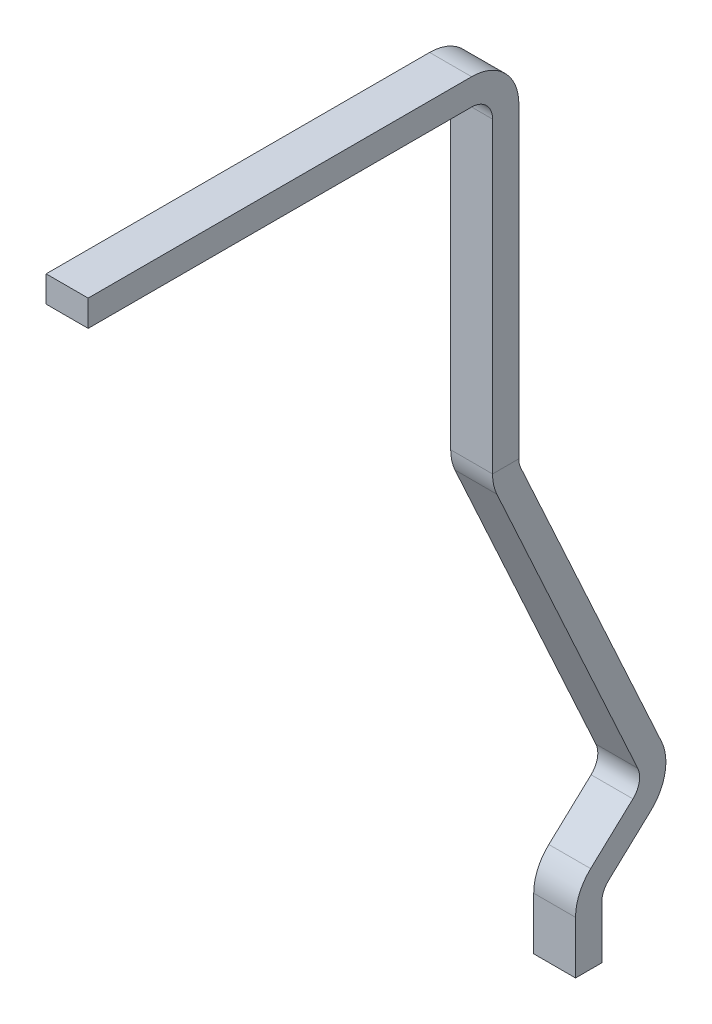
ISO-10303-21;
HEADER;
FILE_DESCRIPTION(('STEP AP214'),'2;1');
FILE_NAME('part.step','',(''),(''),'','','');
FILE_SCHEMA(('AUTOMOTIVE_DESIGN { 1 0 10303 214 1 1 1 1 }'));
ENDSEC;
DATA;
#1=APPLICATION_CONTEXT('core data for automotive mechanical design processes');
#2=APPLICATION_PROTOCOL_DEFINITION('international standard','automotive_design',2000,#1);
#3=PRODUCT_CONTEXT('',#1,'mechanical');
#4=PRODUCT('Part','Part','',(#3));
#5=PRODUCT_RELATED_PRODUCT_CATEGORY('part','',(#4));
#6=PRODUCT_DEFINITION_FORMATION('','',#4);
#7=PRODUCT_DEFINITION_CONTEXT('part definition',#1,'design');
#8=PRODUCT_DEFINITION('design','',#6,#7);
#9=PRODUCT_DEFINITION_SHAPE('','',#8);
#10=(LENGTH_UNIT() NAMED_UNIT(*) SI_UNIT(.MILLI.,.METRE.));
#11=(NAMED_UNIT(*) PLANE_ANGLE_UNIT() SI_UNIT($,.RADIAN.));
#12=(NAMED_UNIT(*) SI_UNIT($,.STERADIAN.) SOLID_ANGLE_UNIT());
#13=UNCERTAINTY_MEASURE_WITH_UNIT(LENGTH_MEASURE(1.E-05),#10,'distance_accuracy_value','');
#14=(GEOMETRIC_REPRESENTATION_CONTEXT(3) GLOBAL_UNCERTAINTY_ASSIGNED_CONTEXT((#13)) GLOBAL_UNIT_ASSIGNED_CONTEXT((#10,
#11,#12)) REPRESENTATION_CONTEXT('',''));
#15=CARTESIAN_POINT('',(0.,0.,0.));
#16=DIRECTION('',(0.,0.,1.));
#17=DIRECTION('',(1.,0.,0.));
#18=AXIS2_PLACEMENT_3D('',#15,#16,#17);
#19=CARTESIAN_POINT('',(0.20000000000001,-1.4625,-0.125));
#20=DIRECTION('',(0.,0.,-1.));
#21=DIRECTION('',(-1.,0.,0.));
#22=AXIS2_PLACEMENT_3D('',#19,#20,#21);
#23=PLANE('',#22);
#24=DIRECTION('',(-1.,0.,0.));
#25=VECTOR('',#24,1.);
#26=CARTESIAN_POINT('',(0.,-1.4625,-0.125));
#27=LINE('',#26,#25);
#28=CARTESIAN_POINT('',(0.199333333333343,-1.4625,-0.125));
#29=VERTEX_POINT('',#28);
#30=CARTESIAN_POINT('',(-0.19933333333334,-1.4625,-0.125));
#31=VERTEX_POINT('',#30);
#32=EDGE_CURVE('E232',#29,#31,#27,.T.);
#33=ORIENTED_EDGE('',*,*,#32,.T.);
#34=DIRECTION('',(0.,-1.,0.));
#35=VECTOR('',#34,1.);
#36=CARTESIAN_POINT('',(-0.2,0.225,-0.125));
#37=LINE('',#36,#35);
#38=CARTESIAN_POINT('',(-0.2,1.4625,-0.125));
#39=VERTEX_POINT('',#38);
#40=EDGE_CURVE('E236',#39,#31,#37,.T.);
#41=ORIENTED_EDGE('',*,*,#40,.F.);
#42=DIRECTION('',(-1.,0.,0.));
#43=VECTOR('',#42,1.);
#44=CARTESIAN_POINT('',(0.,1.4625,-0.125));
#45=LINE('',#44,#43);
#46=CARTESIAN_POINT('',(0.200000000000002,1.46250000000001,-0.125));
#47=VERTEX_POINT('',#46);
#48=EDGE_CURVE('E211',#47,#39,#45,.T.);
#49=ORIENTED_EDGE('',*,*,#48,.F.);
#50=DIRECTION('',(0.,1.,0.));
#51=VECTOR('',#50,1.);
#52=CARTESIAN_POINT('',(0.200000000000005,0.225,-0.125));
#53=LINE('',#52,#51);
#54=EDGE_CURVE('E205',#29,#47,#53,.T.);
#55=ORIENTED_EDGE('',*,*,#54,.F.);
#56=EDGE_LOOP('',(#33,#41,#49,#55));
#57=FACE_BOUND('',#56,.T.);
#58=ADVANCED_FACE('F16',(#57),#23,.T.);
#59=CARTESIAN_POINT('',(-0.2,1.6625,0.325));
#60=DIRECTION('',(0.,-1.,0.));
#61=DIRECTION('',(1.,0.,0.));
#62=AXIS2_PLACEMENT_3D('',#59,#60,#61);
#63=PLANE('',#62);
#64=DIRECTION('',(0.,0.,1.));
#65=VECTOR('',#64,1.);
#66=CARTESIAN_POINT('',(-0.2,1.66250000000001,1.925));
#67=LINE('',#66,#65);
#68=CARTESIAN_POINT('',(-0.2,1.66250000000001,0.325));
#69=VERTEX_POINT('',#68);
#70=CARTESIAN_POINT('',(-0.2,1.66250000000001,3.975));
#71=VERTEX_POINT('',#70);
#72=EDGE_CURVE('E163',#69,#71,#67,.T.);
#73=ORIENTED_EDGE('',*,*,#72,.F.);
#74=DIRECTION('',(-1.,0.,0.));
#75=VECTOR('',#74,1.);
#76=CARTESIAN_POINT('',(0.,1.66250000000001,0.325));
#77=LINE('',#76,#75);
#78=CARTESIAN_POINT('',(0.200000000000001,1.66250000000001,0.325000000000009));
#79=VERTEX_POINT('',#78);
#80=EDGE_CURVE('E159',#79,#69,#77,.T.);
#81=ORIENTED_EDGE('',*,*,#80,.F.);
#82=DIRECTION('',(0.,0.,-1.));
#83=VECTOR('',#82,1.);
#84=CARTESIAN_POINT('',(0.200000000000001,1.66250000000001,1.925));
#85=LINE('',#84,#83);
#86=CARTESIAN_POINT('',(0.200000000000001,1.66250000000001,3.975));
#87=VERTEX_POINT('',#86);
#88=EDGE_CURVE('E193',#87,#79,#85,.T.);
#89=ORIENTED_EDGE('',*,*,#88,.F.);
#90=DIRECTION('',(1.,0.,0.));
#91=VECTOR('',#90,1.);
#92=CARTESIAN_POINT('',(0.,1.6625,3.975));
#93=LINE('',#92,#91);
#94=EDGE_CURVE('E222',#71,#87,#93,.T.);
#95=ORIENTED_EDGE('',*,*,#94,.F.);
#96=EDGE_LOOP('',(#73,#81,#89,#95));
#97=FACE_BOUND('',#96,.T.);
#98=ADVANCED_FACE('F488',(#97),#63,.T.);
#99=CARTESIAN_POINT('',(-0.2,1.9125,3.975));
#100=DIRECTION('',(0.,0.,1.));
#101=DIRECTION('',(0.,-1.,0.));
#102=AXIS2_PLACEMENT_3D('',#99,#100,#101);
#103=PLANE('',#102);
#104=DIRECTION('',(0.,1.,0.));
#105=VECTOR('',#104,1.);
#106=CARTESIAN_POINT('',(-0.2,0.225,3.975));
#107=LINE('',#106,#105);
#108=CARTESIAN_POINT('',(-0.2,1.9125,3.975));
#109=VERTEX_POINT('',#108);
#110=EDGE_CURVE('E225',#71,#109,#107,.T.);
#111=ORIENTED_EDGE('',*,*,#110,.F.);
#112=ORIENTED_EDGE('',*,*,#94,.T.);
#113=DIRECTION('',(0.,-1.,0.));
#114=VECTOR('',#113,1.);
#115=CARTESIAN_POINT('',(0.200000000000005,0.225,3.975));
#116=LINE('',#115,#114);
#117=CARTESIAN_POINT('',(0.2,1.9125,3.975));
#118=VERTEX_POINT('',#117);
#119=EDGE_CURVE('E196',#118,#87,#116,.T.);
#120=ORIENTED_EDGE('',*,*,#119,.F.);
#121=DIRECTION('',(1.,0.,0.));
#122=VECTOR('',#121,1.);
#123=CARTESIAN_POINT('',(0.,1.9125,3.975));
#124=LINE('',#123,#122);
#125=EDGE_CURVE('E218',#109,#118,#124,.T.);
#126=ORIENTED_EDGE('',*,*,#125,.F.);
#127=EDGE_LOOP('',(#111,#112,#120,#126));
#128=FACE_BOUND('',#127,.T.);
#129=ADVANCED_FACE('F486',(#128),#103,.T.);
#130=CARTESIAN_POINT('',(0.2,1.9125,0.325));
#131=DIRECTION('',(0.,1.,0.));
#132=DIRECTION('',(-1.,0.,0.));
#133=AXIS2_PLACEMENT_3D('',#130,#131,#132);
#134=PLANE('',#133);
#135=DIRECTION('',(0.,0.,1.));
#136=VECTOR('',#135,1.);
#137=CARTESIAN_POINT('',(0.2,1.9125,1.925));
#138=LINE('',#137,#136);
#139=CARTESIAN_POINT('',(0.200000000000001,1.9125,0.325000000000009));
#140=VERTEX_POINT('',#139);
#141=EDGE_CURVE('E199',#140,#118,#138,.T.);
#142=ORIENTED_EDGE('',*,*,#141,.F.);
#143=DIRECTION('',(1.,0.,0.));
#144=VECTOR('',#143,1.);
#145=CARTESIAN_POINT('',(0.,1.9125,0.325));
#146=LINE('',#145,#144);
#147=CARTESIAN_POINT('',(-0.2,1.9125,0.325));
#148=VERTEX_POINT('',#147);
#149=EDGE_CURVE('E214',#148,#140,#146,.T.);
#150=ORIENTED_EDGE('',*,*,#149,.F.);
#151=DIRECTION('',(0.,0.,-1.));
#152=VECTOR('',#151,1.);
#153=CARTESIAN_POINT('',(-0.2,1.9125,1.925));
#154=LINE('',#153,#152);
#155=EDGE_CURVE('E228',#109,#148,#154,.T.);
#156=ORIENTED_EDGE('',*,*,#155,.F.);
#157=ORIENTED_EDGE('',*,*,#125,.T.);
#158=EDGE_LOOP('',(#142,#150,#156,#157));
#159=FACE_BOUND('',#158,.T.);
#160=ADVANCED_FACE('F266',(#159),#134,.T.);
#161=CARTESIAN_POINT('',(0.24,1.4625,0.325));
#162=DIRECTION('',(-1.,0.,0.));
#163=DIRECTION('',(0.,0.,1.));
#164=AXIS2_PLACEMENT_3D('',#161,#162,#163);
#165=CYLINDRICAL_SURFACE('',#164,0.45);
#166=CARTESIAN_POINT('',(0.200000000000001,1.46250000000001,-0.125));
#167=CARTESIAN_POINT('',(0.200000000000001,1.50787190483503,-0.124593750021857));
#168=CARTESIAN_POINT('',(0.200000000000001,1.55029064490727,-0.116353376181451));
#169=CARTESIAN_POINT('',(0.200000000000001,1.59182042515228,-0.108285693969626));
#170=CARTESIAN_POINT('',(0.200000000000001,1.6347075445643,-0.090745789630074));
#171=CARTESIAN_POINT('',(0.200000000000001,1.71569158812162,-0.0576250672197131));
#172=CARTESIAN_POINT('',(0.2,1.78069805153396,0.00680194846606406));
#173=CARTESIAN_POINT('',(0.2,1.84284280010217,0.0683927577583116));
#174=CARTESIAN_POINT('',(0.2,1.87824578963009,0.152792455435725));
#175=CARTESIAN_POINT('',(0.2,1.91167158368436,0.232478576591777));
#176=CARTESIAN_POINT('',(0.2,1.9125,0.325000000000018));
#177=B_SPLINE_CURVE_WITH_KNOTS('',2,(#166,#167,#168,#169,#170,#171,#172,#173,#174,#175,#176),
.UNSPECIFIED.,.F.,.F.,(3,2,2,2,2,3),(0.,0.125,0.25,0.5,0.75,1.),.UNSPECIFIED.);
#178=EDGE_CURVE('E202',#47,#140,#177,.T.);
#179=ORIENTED_EDGE('',*,*,#178,.F.);
#180=ORIENTED_EDGE('',*,*,#48,.T.);
#181=CARTESIAN_POINT('',(-0.2,1.4625,0.325));
#182=DIRECTION('',(-1.,0.,0.));
#183=DIRECTION('',(0.,0.,1.));
#184=AXIS2_PLACEMENT_3D('',#181,#182,#183);
#185=CIRCLE('',#184,0.45);
#186=EDGE_CURVE('E181',#148,#39,#185,.T.);
#187=ORIENTED_EDGE('',*,*,#186,.F.);
#188=ORIENTED_EDGE('',*,*,#149,.T.);
#189=EDGE_LOOP('',(#179,#180,#187,#188));
#190=FACE_BOUND('',#189,.T.);
#191=ADVANCED_FACE('F255',(#190),#165,.T.);
#192=CARTESIAN_POINT('',(0.20000000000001,-1.4625,-0.125));
#193=DIRECTION('',(1.,0.,0.));
#194=DIRECTION('',(0.,1.,0.));
#195=AXIS2_PLACEMENT_3D('',#192,#193,#194);
#196=PLANE('',#195);
#197=ORIENTED_EDGE('',*,*,#88,.T.);
#198=CARTESIAN_POINT('',(0.200000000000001,1.4625,0.325));
#199=DIRECTION('',(1.,0.,0.));
#200=DIRECTION('',(0.,0.,-1.));
#201=AXIS2_PLACEMENT_3D('',#198,#199,#200);
#202=CIRCLE('',#201,0.200000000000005);
#203=CARTESIAN_POINT('',(0.200000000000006,1.4625,0.125000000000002));
#204=VERTEX_POINT('',#203);
#205=EDGE_CURVE('E195',#204,#79,#202,.T.);
#206=ORIENTED_EDGE('',*,*,#205,.F.);
#207=DIRECTION('',(0.,1.,0.));
#208=VECTOR('',#207,1.);
#209=CARTESIAN_POINT('',(0.20000000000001,0.,0.125));
#210=LINE('',#209,#208);
#211=CARTESIAN_POINT('',(0.199333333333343,-1.4625,0.125000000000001));
#212=VERTEX_POINT('',#211);
#213=EDGE_CURVE('E179',#212,#204,#210,.T.);
#214=ORIENTED_EDGE('',*,*,#213,.F.);
#215=CARTESIAN_POINT('',(0.20000000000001,-1.4625,0.125000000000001));
#216=DIRECTION('',(0.,0.,-1.));
#217=VECTOR('',#216,1.);
#218=LINE('',#215,#217);
#219=EDGE_CURVE('E208',#212,#29,#218,.T.);
#220=ORIENTED_EDGE('',*,*,#219,.T.);
#221=ORIENTED_EDGE('',*,*,#54,.T.);
#222=ORIENTED_EDGE('',*,*,#178,.T.);
#223=ORIENTED_EDGE('',*,*,#141,.T.);
#224=ORIENTED_EDGE('',*,*,#119,.T.);
#225=EDGE_LOOP('',(#197,#206,#214,#220,#221,#222,#223,#224));
#226=FACE_BOUND('',#225,.T.);
#227=ADVANCED_FACE('F265',(#226),#196,.T.);
#228=CARTESIAN_POINT('',(0.24,1.4625,0.325));
#229=DIRECTION('',(-1.,0.,0.));
#230=DIRECTION('',(0.,0.,1.));
#231=AXIS2_PLACEMENT_3D('',#228,#229,#230);
#232=CYLINDRICAL_SURFACE('',#231,0.200000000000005);
#233=CARTESIAN_POINT('',(-0.2,1.4625,0.325));
#234=DIRECTION('',(-1.,0.,0.));
#235=DIRECTION('',(0.,0.,1.));
#236=AXIS2_PLACEMENT_3D('',#233,#234,#235);
#237=CIRCLE('',#236,0.200000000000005);
#238=CARTESIAN_POINT('',(-0.200000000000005,1.4625,0.125));
#239=VERTEX_POINT('',#238);
#240=EDGE_CURVE('E20',#239,#69,#237,.F.);
#241=ORIENTED_EDGE('',*,*,#240,.F.);
#242=DIRECTION('',(-1.,0.,0.));
#243=VECTOR('',#242,1.);
#244=CARTESIAN_POINT('',(0.,1.4625,0.125));
#245=LINE('',#244,#243);
#246=EDGE_CURVE('E156',#204,#239,#245,.T.);
#247=ORIENTED_EDGE('',*,*,#246,.F.);
#248=ORIENTED_EDGE('',*,*,#205,.T.);
#249=ORIENTED_EDGE('',*,*,#80,.T.);
#250=EDGE_LOOP('',(#241,#247,#248,#249));
#251=FACE_BOUND('',#250,.T.);
#252=ADVANCED_FACE('F153',(#251),#232,.F.);
#253=CARTESIAN_POINT('',(-0.2,1.9125,-0.125));
#254=DIRECTION('',(-1.,0.,0.));
#255=DIRECTION('',(0.,-1.,0.));
#256=AXIS2_PLACEMENT_3D('',#253,#254,#255);
#257=PLANE('',#256);
#258=ORIENTED_EDGE('',*,*,#155,.T.);
#259=ORIENTED_EDGE('',*,*,#186,.T.);
#260=ORIENTED_EDGE('',*,*,#40,.T.);
#261=CARTESIAN_POINT('',(-0.2,-1.4625,-0.124999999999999));
#262=DIRECTION('',(0.,0.,1.));
#263=VECTOR('',#262,1.);
#264=LINE('',#261,#263);
#265=CARTESIAN_POINT('',(-0.19933333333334,-1.4625,0.125000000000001));
#266=VERTEX_POINT('',#265);
#267=EDGE_CURVE('E164',#31,#266,#264,.T.);
#268=ORIENTED_EDGE('',*,*,#267,.T.);
#269=DIRECTION('',(0.,-1.,0.));
#270=VECTOR('',#269,1.);
#271=CARTESIAN_POINT('',(-0.20000000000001,0.,0.125));
#272=LINE('',#271,#270);
#273=EDGE_CURVE('E167',#239,#266,#272,.T.);
#274=ORIENTED_EDGE('',*,*,#273,.F.);
#275=ORIENTED_EDGE('',*,*,#240,.T.);
#276=ORIENTED_EDGE('',*,*,#72,.T.);
#277=ORIENTED_EDGE('',*,*,#110,.T.);
#278=EDGE_LOOP('',(#258,#259,#260,#268,#274,#275,#276,#277));
#279=FACE_BOUND('',#278,.T.);
#280=ADVANCED_FACE('F169',(#279),#257,.T.);
#281=CARTESIAN_POINT('',(-0.20000000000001,-1.4625,0.125));
#282=DIRECTION('',(0.,0.,1.));
#283=DIRECTION('',(1.,0.,0.));
#284=AXIS2_PLACEMENT_3D('',#281,#282,#283);
#285=PLANE('',#284);
#286=DIRECTION('',(-1.,0.,0.));
#287=VECTOR('',#286,1.);
#288=CARTESIAN_POINT('',(0.,-1.4625,0.125));
#289=LINE('',#288,#287);
#290=EDGE_CURVE('E442',#212,#266,#289,.T.);
#291=ORIENTED_EDGE('',*,*,#290,.F.);
#292=ORIENTED_EDGE('',*,*,#213,.T.);
#293=ORIENTED_EDGE('',*,*,#246,.T.);
#294=ORIENTED_EDGE('',*,*,#273,.T.);
#295=EDGE_LOOP('',(#291,#292,#293,#294));
#296=FACE_BOUND('',#295,.T.);
#297=ADVANCED_FACE('F177',(#296),#285,.T.);
#298=CARTESIAN_POINT('',(-0.19900000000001,-1.4625,-1.5349));
#299=DIRECTION('',(-1.,0.,0.));
#300=DIRECTION('',(0.,-1.,0.));
#301=AXIS2_PLACEMENT_3D('',#298,#299,#300);
#302=PLANE('',#301);
#303=CARTESIAN_POINT('',(-0.199000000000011,-1.4625,-0.325000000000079));
#304=DIRECTION('',(1.,0.,0.));
#305=DIRECTION('',(0.,0.,-1.));
#306=AXIS2_PLACEMENT_3D('',#303,#304,#305);
#307=CIRCLE('',#306,0.450000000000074);
#308=CARTESIAN_POINT('',(-0.199000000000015,-1.64980458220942,0.0841662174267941));
#309=VERTEX_POINT('',#308);
#310=EDGE_CURVE('E444',#266,#309,#307,.T.);
#311=ORIENTED_EDGE('',*,*,#310,.F.);
#312=ORIENTED_EDGE('',*,*,#267,.F.);
#313=CARTESIAN_POINT('',(-0.19900000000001,-1.4625,-0.32499999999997));
#314=DIRECTION('',(1.,0.,0.));
#315=DIRECTION('',(0.,0.,-1.));
#316=AXIS2_PLACEMENT_3D('',#313,#314,#315);
#317=CIRCLE('',#316,0.199999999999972);
#318=CARTESIAN_POINT('',(-0.199000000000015,-1.54574648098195,-0.143148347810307));
#319=VERTEX_POINT('',#318);
#320=EDGE_CURVE('E454',#319,#31,#317,.F.);
#321=ORIENTED_EDGE('',*,*,#320,.F.);
#322=DIRECTION('',(0.,0.909258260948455,0.416232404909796));
#323=VECTOR('',#322,1.);
#324=CARTESIAN_POINT('',(-0.19900000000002,-3.01047094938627,-0.81365728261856));
#325=LINE('',#324,#323);
#326=CARTESIAN_POINT('',(-0.199000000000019,-4.47519541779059,-1.48416621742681));
#327=VERTEX_POINT('',#326);
#328=EDGE_CURVE('E447',#327,#319,#325,.T.);
#329=ORIENTED_EDGE('',*,*,#328,.F.);
#330=CARTESIAN_POINT('',(-0.199000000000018,-4.66250000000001,-1.07499999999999));
#331=DIRECTION('',(-1.,0.,0.));
#332=DIRECTION('',(0.,0.,1.));
#333=AXIS2_PLACEMENT_3D('',#330,#331,#332);
#334=CIRCLE('',#333,0.450000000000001);
#335=CARTESIAN_POINT('',(-0.199000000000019,-4.99220548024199,-1.38125854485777));
#336=VERTEX_POINT('',#335);
#337=EDGE_CURVE('E451',#336,#327,#334,.F.);
#338=ORIENTED_EDGE('',*,*,#337,.F.);
#339=DIRECTION('',(0.,0.680574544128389,-0.73267884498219));
#340=VECTOR('',#339,1.);
#341=CARTESIAN_POINT('',(-0.19900000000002,-5.17908485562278,-1.18007181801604));
#342=LINE('',#341,#340);
#343=CARTESIAN_POINT('',(-0.199000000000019,-5.36596423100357,-0.978885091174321));
#344=VERTEX_POINT('',#343);
#345=EDGE_CURVE('E460',#344,#336,#342,.T.);
#346=ORIENTED_EDGE('',*,*,#345,.F.);
#347=CARTESIAN_POINT('',(-0.199000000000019,-5.5125,-1.115));
#348=DIRECTION('',(1.,0.,0.));
#349=DIRECTION('',(0.,0.,-1.));
#350=AXIS2_PLACEMENT_3D('',#347,#348,#349);
#351=CIRCLE('',#350,0.199999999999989);
#352=CARTESIAN_POINT('',(-0.199000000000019,-5.5125,-0.915000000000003));
#353=VERTEX_POINT('',#352);
#354=EDGE_CURVE('E428',#353,#344,#351,.F.);
#355=ORIENTED_EDGE('',*,*,#354,.F.);
#356=DIRECTION('',(0.,-1.,0.));
#357=VECTOR('',#356,1.);
#358=CARTESIAN_POINT('',(-0.199000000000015,-3.7375,-0.915000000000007));
#359=LINE('',#358,#357);
#360=CARTESIAN_POINT('',(-0.19900000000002,-6.0125,-0.915000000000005));
#361=VERTEX_POINT('',#360);
#362=EDGE_CURVE('E175',#353,#361,#359,.T.);
#363=ORIENTED_EDGE('',*,*,#362,.T.);
#364=DIRECTION('',(0.,0.,1.));
#365=VECTOR('',#364,1.);
#366=CARTESIAN_POINT('',(-0.19900000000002,-6.0125,-0.7));
#367=LINE('',#366,#365);
#368=CARTESIAN_POINT('',(-0.19900000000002,-6.0125,-0.665000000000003));
#369=VERTEX_POINT('',#368);
#370=EDGE_CURVE('E408',#361,#369,#367,.T.);
#371=ORIENTED_EDGE('',*,*,#370,.T.);
#372=DIRECTION('',(0.,1.,0.));
#373=VECTOR('',#372,1.);
#374=CARTESIAN_POINT('',(-0.199000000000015,-3.7375,-0.665000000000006));
#375=LINE('',#374,#373);
#376=CARTESIAN_POINT('',(-0.199000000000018,-5.5125,-0.665000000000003));
#377=VERTEX_POINT('',#376);
#378=EDGE_CURVE('E452',#369,#377,#375,.T.);
#379=ORIENTED_EDGE('',*,*,#378,.T.);
#380=CARTESIAN_POINT('',(-0.199000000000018,-5.5125,-1.11499999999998));
#381=DIRECTION('',(1.,0.,0.));
#382=DIRECTION('',(0.,0.,-1.));
#383=AXIS2_PLACEMENT_3D('',#380,#381,#382);
#384=CIRCLE('',#383,0.449999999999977);
#385=CARTESIAN_POINT('',(-0.199000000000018,-5.18279451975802,-0.808741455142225));
#386=VERTEX_POINT('',#385);
#387=EDGE_CURVE('E429',#386,#377,#384,.T.);
#388=ORIENTED_EDGE('',*,*,#387,.F.);
#389=DIRECTION('',(0.,-0.680574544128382,0.732678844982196));
#390=VECTOR('',#389,1.);
#391=CARTESIAN_POINT('',(-0.19900000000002,-4.99591514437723,-1.00992818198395));
#392=LINE('',#391,#390);
#393=CARTESIAN_POINT('',(-0.199000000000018,-4.80903576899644,-1.21111490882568));
#394=VERTEX_POINT('',#393);
#395=EDGE_CURVE('E433',#394,#386,#392,.T.);
#396=ORIENTED_EDGE('',*,*,#395,.F.);
#397=CARTESIAN_POINT('',(-0.199000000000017,-4.6625,-1.07499999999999));
#398=DIRECTION('',(-1.,0.,0.));
#399=DIRECTION('',(0.,0.,1.));
#400=AXIS2_PLACEMENT_3D('',#397,#398,#399);
#401=CIRCLE('',#400,0.200000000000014);
#402=CARTESIAN_POINT('',(-0.199000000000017,-4.57925351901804,-1.25685165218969));
#403=VERTEX_POINT('',#402);
#404=EDGE_CURVE('E437',#403,#394,#401,.T.);
#405=ORIENTED_EDGE('',*,*,#404,.F.);
#406=DIRECTION('',(0.,-0.909258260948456,-0.416232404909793));
#407=VECTOR('',#406,1.);
#408=CARTESIAN_POINT('',(-0.19900000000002,-3.11452905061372,-0.586342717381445));
#409=LINE('',#408,#407);
#410=EDGE_CURVE('E441',#309,#403,#409,.T.);
#411=ORIENTED_EDGE('',*,*,#410,.F.);
#412=EDGE_LOOP('',(#311,#312,#321,#329,#338,#346,#355,#363,#371,#379,#388,#396,#405,#411));
#413=FACE_BOUND('',#412,.T.);
#414=ADVANCED_FACE('F321',(#413),#302,.T.);
#415=CARTESIAN_POINT('',(-0.23880000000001,-1.4625,-0.32499999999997));
#416=DIRECTION('',(1.,0.,0.));
#417=DIRECTION('',(0.,0.,-1.));
#418=AXIS2_PLACEMENT_3D('',#415,#416,#417);
#419=CYLINDRICAL_SURFACE('',#418,0.199999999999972);
#420=CARTESIAN_POINT('',(0.19900000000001,-1.4625,-0.32499999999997));
#421=DIRECTION('',(1.,0.,0.));
#422=DIRECTION('',(0.,0.,-1.));
#423=AXIS2_PLACEMENT_3D('',#420,#421,#422);
#424=CIRCLE('',#423,0.199999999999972);
#425=CARTESIAN_POINT('',(0.19900000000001,-1.54574648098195,-0.143148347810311));
#426=VERTEX_POINT('',#425);
#427=EDGE_CURVE('E619',#426,#29,#424,.F.);
#428=ORIENTED_EDGE('',*,*,#427,.F.);
#429=DIRECTION('',(1.,0.,0.));
#430=VECTOR('',#429,1.);
#431=CARTESIAN_POINT('',(0.,-1.54574648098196,-0.14314834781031));
#432=LINE('',#431,#430);
#433=EDGE_CURVE('E450',#319,#426,#432,.T.);
#434=ORIENTED_EDGE('',*,*,#433,.F.);
#435=ORIENTED_EDGE('',*,*,#320,.T.);
#436=ORIENTED_EDGE('',*,*,#32,.F.);
#437=EDGE_LOOP('',(#428,#434,#435,#436));
#438=FACE_BOUND('',#437,.T.);
#439=ADVANCED_FACE('F325',(#438),#419,.F.);
#440=CARTESIAN_POINT('',(-0.238800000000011,-1.4625,-0.325000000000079));
#441=DIRECTION('',(1.,0.,0.));
#442=DIRECTION('',(0.,0.,-1.));
#443=AXIS2_PLACEMENT_3D('',#440,#441,#442);
#444=CYLINDRICAL_SURFACE('',#443,0.450000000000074);
#445=CARTESIAN_POINT('',(0.19900000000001,-1.4625,-0.32500000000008));
#446=DIRECTION('',(1.,0.,0.));
#447=DIRECTION('',(0.,0.,-1.));
#448=AXIS2_PLACEMENT_3D('',#445,#446,#447);
#449=CIRCLE('',#448,0.450000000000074);
#450=CARTESIAN_POINT('',(0.199000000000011,-1.64980458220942,0.0841662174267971));
#451=VERTEX_POINT('',#450);
#452=EDGE_CURVE('E615',#212,#451,#449,.T.);
#453=ORIENTED_EDGE('',*,*,#452,.F.);
#454=ORIENTED_EDGE('',*,*,#290,.T.);
#455=ORIENTED_EDGE('',*,*,#310,.T.);
#456=DIRECTION('',(-1.,0.,0.));
#457=VECTOR('',#456,1.);
#458=CARTESIAN_POINT('',(0.,-1.64980458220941,0.0841662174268));
#459=LINE('',#458,#457);
#460=EDGE_CURVE('E438',#451,#309,#459,.T.);
#461=ORIENTED_EDGE('',*,*,#460,.F.);
#462=EDGE_LOOP('',(#453,#454,#455,#461));
#463=FACE_BOUND('',#462,.T.);
#464=ADVANCED_FACE('F391',(#463),#444,.T.);
#465=CARTESIAN_POINT('',(-0.19900000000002,-1.64980458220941,0.0841662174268));
#466=DIRECTION('',(0.,-0.416232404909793,0.909258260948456));
#467=DIRECTION('',(0.,-0.909258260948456,-0.416232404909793));
#468=AXIS2_PLACEMENT_3D('',#465,#466,#467);
#469=PLANE('',#468);
#470=DIRECTION('',(0.,-0.909258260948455,-0.416232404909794));
#471=VECTOR('',#470,1.);
#472=CARTESIAN_POINT('',(0.19900000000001,-1.64980458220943,0.0841662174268));
#473=LINE('',#472,#471);
#474=CARTESIAN_POINT('',(0.199000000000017,-4.57925351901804,-1.25685165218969));
#475=VERTEX_POINT('',#474);
#476=EDGE_CURVE('E618',#451,#475,#473,.T.);
#477=ORIENTED_EDGE('',*,*,#476,.F.);
#478=ORIENTED_EDGE('',*,*,#460,.T.);
#479=ORIENTED_EDGE('',*,*,#410,.T.);
#480=DIRECTION('',(-1.,0.,0.));
#481=VECTOR('',#480,1.);
#482=CARTESIAN_POINT('',(0.,-4.57925351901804,-1.2568516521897));
#483=LINE('',#482,#481);
#484=EDGE_CURVE('E434',#475,#403,#483,.T.);
#485=ORIENTED_EDGE('',*,*,#484,.F.);
#486=EDGE_LOOP('',(#477,#478,#479,#485));
#487=FACE_BOUND('',#486,.T.);
#488=ADVANCED_FACE('F388',(#487),#469,.T.);
#489=CARTESIAN_POINT('',(0.23880000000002,-4.6625,-1.07499999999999));
#490=DIRECTION('',(-1.,0.,0.));
#491=DIRECTION('',(0.,0.,1.));
#492=AXIS2_PLACEMENT_3D('',#489,#490,#491);
#493=CYLINDRICAL_SURFACE('',#492,0.200000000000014);
#494=CARTESIAN_POINT('',(0.199000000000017,-4.6625,-1.07499999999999));
#495=DIRECTION('',(-1.,0.,0.));
#496=DIRECTION('',(0.,0.,1.));
#497=AXIS2_PLACEMENT_3D('',#494,#495,#496);
#498=CIRCLE('',#497,0.200000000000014);
#499=CARTESIAN_POINT('',(0.199000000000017,-4.80903576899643,-1.21111490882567));
#500=VERTEX_POINT('',#499);
#501=EDGE_CURVE('E621',#475,#500,#498,.T.);
#502=ORIENTED_EDGE('',*,*,#501,.F.);
#503=ORIENTED_EDGE('',*,*,#484,.T.);
#504=ORIENTED_EDGE('',*,*,#404,.T.);
#505=DIRECTION('',(-1.,0.,0.));
#506=VECTOR('',#505,1.);
#507=CARTESIAN_POINT('',(0.,-4.80903576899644,-1.21111490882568));
#508=LINE('',#507,#506);
#509=EDGE_CURVE('E430',#500,#394,#508,.T.);
#510=ORIENTED_EDGE('',*,*,#509,.F.);
#511=EDGE_LOOP('',(#502,#503,#504,#510));
#512=FACE_BOUND('',#511,.T.);
#513=ADVANCED_FACE('F384',(#512),#493,.F.);
#514=CARTESIAN_POINT('',(-0.19900000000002,-4.80903576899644,-1.21111490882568));
#515=DIRECTION('',(0.,0.732678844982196,0.680574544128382));
#516=DIRECTION('',(0.,-0.680574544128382,0.732678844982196));
#517=AXIS2_PLACEMENT_3D('',#514,#515,#516);
#518=PLANE('',#517);
#519=DIRECTION('',(0.,-0.680574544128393,0.732678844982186));
#520=VECTOR('',#519,1.);
#521=CARTESIAN_POINT('',(0.199000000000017,-4.80903576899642,-1.21111490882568));
#522=LINE('',#521,#520);
#523=CARTESIAN_POINT('',(0.199000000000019,-5.18279451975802,-0.80874145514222));
#524=VERTEX_POINT('',#523);
#525=EDGE_CURVE('E654',#500,#524,#522,.T.);
#526=ORIENTED_EDGE('',*,*,#525,.F.);
#527=ORIENTED_EDGE('',*,*,#509,.T.);
#528=ORIENTED_EDGE('',*,*,#395,.T.);
#529=DIRECTION('',(-1.,0.,0.));
#530=VECTOR('',#529,1.);
#531=CARTESIAN_POINT('',(0.,-5.18279451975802,-0.80874145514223));
#532=LINE('',#531,#530);
#533=EDGE_CURVE('E425',#524,#386,#532,.T.);
#534=ORIENTED_EDGE('',*,*,#533,.F.);
#535=EDGE_LOOP('',(#526,#527,#528,#534));
#536=FACE_BOUND('',#535,.T.);
#537=ADVANCED_FACE('F380',(#536),#518,.T.);
#538=CARTESIAN_POINT('',(-0.23880000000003,-5.5125,-1.11499999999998));
#539=DIRECTION('',(1.,0.,0.));
#540=DIRECTION('',(0.,0.,-1.));
#541=AXIS2_PLACEMENT_3D('',#538,#539,#540);
#542=CYLINDRICAL_SURFACE('',#541,0.449999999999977);
#543=CARTESIAN_POINT('',(0.199000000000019,-5.5125,-1.11499999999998));
#544=DIRECTION('',(1.,0.,0.));
#545=DIRECTION('',(0.,0.,-1.));
#546=AXIS2_PLACEMENT_3D('',#543,#544,#545);
#547=CIRCLE('',#546,0.449999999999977);
#548=CARTESIAN_POINT('',(0.199000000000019,-5.5125,-0.665000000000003));
#549=VERTEX_POINT('',#548);
#550=EDGE_CURVE('E655',#524,#549,#547,.T.);
#551=ORIENTED_EDGE('',*,*,#550,.F.);
#552=ORIENTED_EDGE('',*,*,#533,.T.);
#553=ORIENTED_EDGE('',*,*,#387,.T.);
#554=DIRECTION('',(-1.,0.,0.));
#555=VECTOR('',#554,1.);
#556=CARTESIAN_POINT('',(0.,-5.5125,-0.665));
#557=LINE('',#556,#555);
#558=EDGE_CURVE('E418',#549,#377,#557,.T.);
#559=ORIENTED_EDGE('',*,*,#558,.F.);
#560=EDGE_LOOP('',(#551,#552,#553,#559));
#561=FACE_BOUND('',#560,.T.);
#562=ADVANCED_FACE('F376',(#561),#542,.T.);
#563=CARTESIAN_POINT('',(-0.23880000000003,-5.5125,-1.115));
#564=DIRECTION('',(1.,0.,0.));
#565=DIRECTION('',(0.,0.,-1.));
#566=AXIS2_PLACEMENT_3D('',#563,#564,#565);
#567=CYLINDRICAL_SURFACE('',#566,0.199999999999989);
#568=CARTESIAN_POINT('',(0.199000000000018,-5.5125,-1.115));
#569=DIRECTION('',(1.,0.,0.));
#570=DIRECTION('',(0.,0.,-1.));
#571=AXIS2_PLACEMENT_3D('',#568,#569,#570);
#572=CIRCLE('',#571,0.199999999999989);
#573=CARTESIAN_POINT('',(0.199000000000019,-5.5125,-0.915000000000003));
#574=VERTEX_POINT('',#573);
#575=CARTESIAN_POINT('',(0.199000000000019,-5.36596423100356,-0.97888509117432));
#576=VERTEX_POINT('',#575);
#577=EDGE_CURVE('E660',#574,#576,#572,.F.);
#578=ORIENTED_EDGE('',*,*,#577,.F.);
#579=DIRECTION('',(1.,0.,0.));
#580=VECTOR('',#579,1.);
#581=CARTESIAN_POINT('',(0.,-5.5125,-0.915));
#582=LINE('',#581,#580);
#583=EDGE_CURVE('E420',#353,#574,#582,.T.);
#584=ORIENTED_EDGE('',*,*,#583,.F.);
#585=ORIENTED_EDGE('',*,*,#354,.T.);
#586=DIRECTION('',(-1.,0.,0.));
#587=VECTOR('',#586,1.);
#588=CARTESIAN_POINT('',(0.,-5.36596423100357,-0.97888509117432));
#589=LINE('',#588,#587);
#590=EDGE_CURVE('E462',#576,#344,#589,.T.);
#591=ORIENTED_EDGE('',*,*,#590,.F.);
#592=EDGE_LOOP('',(#578,#584,#585,#591));
#593=FACE_BOUND('',#592,.T.);
#594=ADVANCED_FACE('F372',(#593),#567,.F.);
#595=CARTESIAN_POINT('',(-0.19900000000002,-5.36596423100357,-0.97888509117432));
#596=DIRECTION('',(0.,-0.73267884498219,-0.680574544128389));
#597=DIRECTION('',(0.,0.680574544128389,-0.73267884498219));
#598=AXIS2_PLACEMENT_3D('',#595,#596,#597);
#599=PLANE('',#598);
#600=DIRECTION('',(0.,0.680574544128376,-0.732678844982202));
#601=VECTOR('',#600,1.);
#602=CARTESIAN_POINT('',(0.199000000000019,-5.36596423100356,-0.978885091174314));
#603=LINE('',#602,#601);
#604=CARTESIAN_POINT('',(0.199000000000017,-4.99220548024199,-1.38125854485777));
#605=VERTEX_POINT('',#604);
#606=EDGE_CURVE('E663',#576,#605,#603,.T.);
#607=ORIENTED_EDGE('',*,*,#606,.F.);
#608=ORIENTED_EDGE('',*,*,#590,.T.);
#609=ORIENTED_EDGE('',*,*,#345,.T.);
#610=DIRECTION('',(-1.,0.,0.));
#611=VECTOR('',#610,1.);
#612=CARTESIAN_POINT('',(0.,-4.99220548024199,-1.38125854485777));
#613=LINE('',#612,#611);
#614=EDGE_CURVE('E632',#605,#336,#613,.T.);
#615=ORIENTED_EDGE('',*,*,#614,.F.);
#616=EDGE_LOOP('',(#607,#608,#609,#615));
#617=FACE_BOUND('',#616,.T.);
#618=ADVANCED_FACE('F368',(#617),#599,.T.);
#619=CARTESIAN_POINT('',(0.23880000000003,-4.66250000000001,-1.07499999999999));
#620=DIRECTION('',(-1.,0.,0.));
#621=DIRECTION('',(0.,0.,1.));
#622=AXIS2_PLACEMENT_3D('',#619,#620,#621);
#623=CYLINDRICAL_SURFACE('',#622,0.450000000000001);
#624=DIRECTION('',(-1.,0.,0.));
#625=VECTOR('',#624,1.);
#626=CARTESIAN_POINT('',(0.,-4.47519541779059,-1.48416621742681));
#627=LINE('',#626,#625);
#628=CARTESIAN_POINT('',(0.199000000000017,-4.4751954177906,-1.48416621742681));
#629=VERTEX_POINT('',#628);
#630=EDGE_CURVE('E421',#629,#327,#627,.T.);
#631=ORIENTED_EDGE('',*,*,#630,.F.);
#632=CARTESIAN_POINT('',(0.199000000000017,-4.66250000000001,-1.07499999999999));
#633=DIRECTION('',(-1.,0.,0.));
#634=DIRECTION('',(0.,0.,1.));
#635=AXIS2_PLACEMENT_3D('',#632,#633,#634);
#636=CIRCLE('',#635,0.450000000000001);
#637=EDGE_CURVE('E665',#605,#629,#636,.F.);
#638=ORIENTED_EDGE('',*,*,#637,.F.);
#639=ORIENTED_EDGE('',*,*,#614,.T.);
#640=ORIENTED_EDGE('',*,*,#337,.T.);
#641=EDGE_LOOP('',(#631,#638,#639,#640));
#642=FACE_BOUND('',#641,.T.);
#643=ADVANCED_FACE('F364',(#642),#623,.T.);
#644=CARTESIAN_POINT('',(-0.19900000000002,-4.47519541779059,-1.48416621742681));
#645=DIRECTION('',(0.,0.416232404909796,-0.909258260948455));
#646=DIRECTION('',(0.,0.909258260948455,0.416232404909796));
#647=AXIS2_PLACEMENT_3D('',#644,#645,#646);
#648=PLANE('',#647);
#649=DIRECTION('',(0.,0.909258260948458,0.416232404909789));
#650=VECTOR('',#649,1.);
#651=CARTESIAN_POINT('',(0.199000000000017,-4.4751954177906,-1.4841662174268));
#652=LINE('',#651,#650);
#653=EDGE_CURVE('E343',#629,#426,#652,.T.);
#654=ORIENTED_EDGE('',*,*,#653,.F.);
#655=ORIENTED_EDGE('',*,*,#630,.T.);
#656=ORIENTED_EDGE('',*,*,#328,.T.);
#657=ORIENTED_EDGE('',*,*,#433,.T.);
#658=EDGE_LOOP('',(#654,#655,#656,#657));
#659=FACE_BOUND('',#658,.T.);
#660=ADVANCED_FACE('F360',(#659),#648,.T.);
#661=CARTESIAN_POINT('',(-0.19900000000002,-5.5125,-0.665));
#662=DIRECTION('',(0.,0.,1.));
#663=DIRECTION('',(0.,-1.,0.));
#664=AXIS2_PLACEMENT_3D('',#661,#662,#663);
#665=PLANE('',#664);
#666=DIRECTION('',(0.,-1.,0.));
#667=VECTOR('',#666,1.);
#668=CARTESIAN_POINT('',(0.199000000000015,-3.7375,-0.665000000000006));
#669=LINE('',#668,#667);
#670=CARTESIAN_POINT('',(0.19900000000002,-6.0125,-0.665000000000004));
#671=VERTEX_POINT('',#670);
#672=EDGE_CURVE('E659',#549,#671,#669,.T.);
#673=ORIENTED_EDGE('',*,*,#672,.F.);
#674=ORIENTED_EDGE('',*,*,#558,.T.);
#675=ORIENTED_EDGE('',*,*,#378,.F.);
#676=DIRECTION('',(-1.,0.,0.));
#677=VECTOR('',#676,1.);
#678=CARTESIAN_POINT('',(0.,-6.0125,-0.665));
#679=LINE('',#678,#677);
#680=EDGE_CURVE('E410',#671,#369,#679,.T.);
#681=ORIENTED_EDGE('',*,*,#680,.F.);
#682=EDGE_LOOP('',(#673,#674,#675,#681));
#683=FACE_BOUND('',#682,.T.);
#684=ADVANCED_FACE('F357',(#683),#665,.T.);
#685=CARTESIAN_POINT('',(-0.19900000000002,-6.0125,-0.915));
#686=DIRECTION('',(0.,0.,-1.));
#687=DIRECTION('',(0.,1.,0.));
#688=AXIS2_PLACEMENT_3D('',#685,#686,#687);
#689=PLANE('',#688);
#690=DIRECTION('',(0.,1.,0.));
#691=VECTOR('',#690,1.);
#692=CARTESIAN_POINT('',(0.199000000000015,-3.7375,-0.915000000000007));
#693=LINE('',#692,#691);
#694=CARTESIAN_POINT('',(0.19900000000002,-6.0125,-0.915000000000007));
#695=VERTEX_POINT('',#694);
#696=EDGE_CURVE('E35',#695,#574,#693,.T.);
#697=ORIENTED_EDGE('',*,*,#696,.F.);
#698=DIRECTION('',(1.,0.,0.));
#699=VECTOR('',#698,1.);
#700=CARTESIAN_POINT('',(0.,-6.0125,-0.915));
#701=LINE('',#700,#699);
#702=EDGE_CURVE('E26',#361,#695,#701,.T.);
#703=ORIENTED_EDGE('',*,*,#702,.F.);
#704=ORIENTED_EDGE('',*,*,#362,.F.);
#705=ORIENTED_EDGE('',*,*,#583,.T.);
#706=EDGE_LOOP('',(#697,#703,#704,#705));
#707=FACE_BOUND('',#706,.T.);
#708=ADVANCED_FACE('F354',(#707),#689,.T.);
#709=CARTESIAN_POINT('',(0.19900000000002,-6.0125,-1.5349));
#710=DIRECTION('',(1.,0.,0.));
#711=DIRECTION('',(0.,1.,0.));
#712=AXIS2_PLACEMENT_3D('',#709,#710,#711);
#713=PLANE('',#712);
#714=ORIENTED_EDGE('',*,*,#637,.T.);
#715=ORIENTED_EDGE('',*,*,#653,.T.);
#716=ORIENTED_EDGE('',*,*,#427,.T.);
#717=ORIENTED_EDGE('',*,*,#219,.F.);
#718=ORIENTED_EDGE('',*,*,#452,.T.);
#719=ORIENTED_EDGE('',*,*,#476,.T.);
#720=ORIENTED_EDGE('',*,*,#501,.T.);
#721=ORIENTED_EDGE('',*,*,#525,.T.);
#722=ORIENTED_EDGE('',*,*,#550,.T.);
#723=ORIENTED_EDGE('',*,*,#672,.T.);
#724=DIRECTION('',(0.,0.,1.));
#725=VECTOR('',#724,1.);
#726=CARTESIAN_POINT('',(0.19900000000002,-6.0125,-0.79));
#727=LINE('',#726,#725);
#728=EDGE_CURVE('E10',#695,#671,#727,.T.);
#729=ORIENTED_EDGE('',*,*,#728,.F.);
#730=ORIENTED_EDGE('',*,*,#696,.T.);
#731=ORIENTED_EDGE('',*,*,#577,.T.);
#732=ORIENTED_EDGE('',*,*,#606,.T.);
#733=EDGE_LOOP('',(#714,#715,#716,#717,#718,#719,#720,#721,#722,#723,#729,#730,#731,#732));
#734=FACE_BOUND('',#733,.T.);
#735=ADVANCED_FACE('F345',(#734),#713,.T.);
#736=CARTESIAN_POINT('',(-0.19900000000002,-6.0125,-0.665));
#737=DIRECTION('',(0.,-1.,0.));
#738=DIRECTION('',(0.,0.,-1.));
#739=AXIS2_PLACEMENT_3D('',#736,#737,#738);
#740=PLANE('',#739);
#741=ORIENTED_EDGE('',*,*,#702,.T.);
#742=ORIENTED_EDGE('',*,*,#728,.T.);
#743=ORIENTED_EDGE('',*,*,#680,.T.);
#744=ORIENTED_EDGE('',*,*,#370,.F.);
#745=EDGE_LOOP('',(#741,#742,#743,#744));
#746=FACE_BOUND('',#745,.T.);
#747=ADVANCED_FACE('F18',(#746),#740,.T.);
#748=CLOSED_SHELL('',(#58,#98,#129,#160,#191,#227,#252,#280,#297,#414,#439,#464,#488,#513,#537,
#562,#594,#618,#643,#660,#684,#708,#735,#747));
#749=MANIFOLD_SOLID_BREP('B1',#748);
#750=ADVANCED_BREP_SHAPE_REPRESENTATION('',(#18,#749),#14);
#751=SHAPE_DEFINITION_REPRESENTATION(#9,#750);
ENDSEC;
END-ISO-10303-21;
